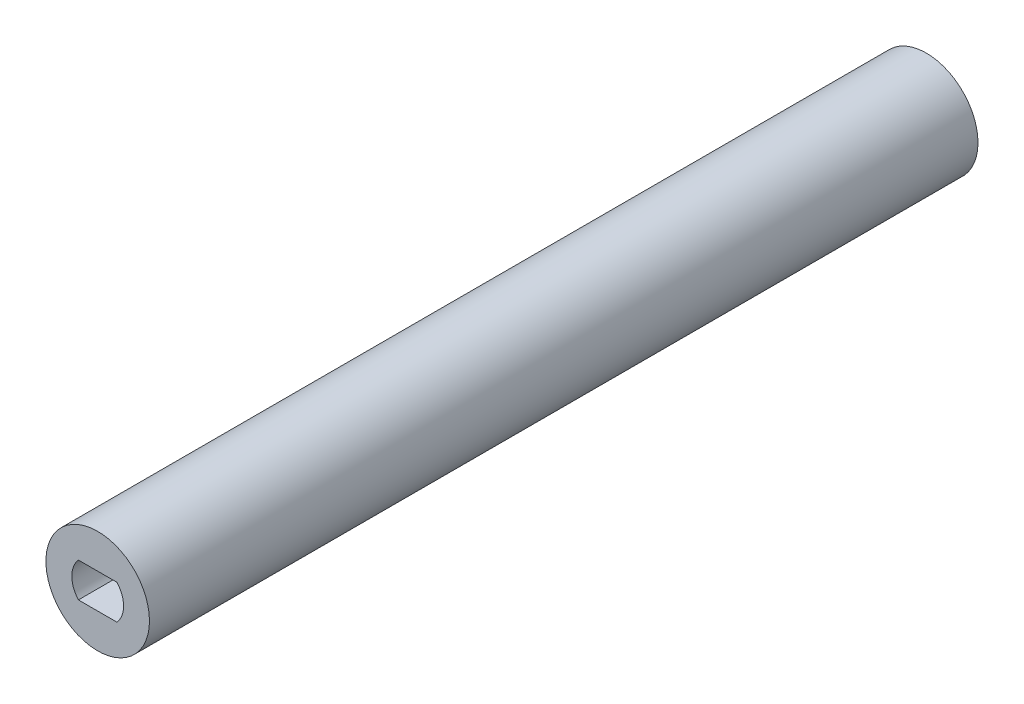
ISO-10303-21;
HEADER;
FILE_DESCRIPTION(('STEP AP214'),'2;1');
FILE_NAME('part.step','',(''),(''),'','','');
FILE_SCHEMA(('AUTOMOTIVE_DESIGN { 1 0 10303 214 1 1 1 1 }'));
ENDSEC;
DATA;
#1=APPLICATION_CONTEXT('core data for automotive mechanical design processes');
#2=APPLICATION_PROTOCOL_DEFINITION('international standard','automotive_design',2000,#1);
#3=PRODUCT_CONTEXT('',#1,'mechanical');
#4=PRODUCT('Part','Part','',(#3));
#5=PRODUCT_RELATED_PRODUCT_CATEGORY('part','',(#4));
#6=PRODUCT_DEFINITION_FORMATION('','',#4);
#7=PRODUCT_DEFINITION_CONTEXT('part definition',#1,'design');
#8=PRODUCT_DEFINITION('design','',#6,#7);
#9=PRODUCT_DEFINITION_SHAPE('','',#8);
#10=(LENGTH_UNIT() NAMED_UNIT(*) SI_UNIT(.MILLI.,.METRE.));
#11=(NAMED_UNIT(*) PLANE_ANGLE_UNIT() SI_UNIT($,.RADIAN.));
#12=(NAMED_UNIT(*) SI_UNIT($,.STERADIAN.) SOLID_ANGLE_UNIT());
#13=UNCERTAINTY_MEASURE_WITH_UNIT(LENGTH_MEASURE(1.E-05),#10,'distance_accuracy_value','');
#14=(GEOMETRIC_REPRESENTATION_CONTEXT(3) GLOBAL_UNCERTAINTY_ASSIGNED_CONTEXT((#13)) GLOBAL_UNIT_ASSIGNED_CONTEXT((#10,
#11,#12)) REPRESENTATION_CONTEXT('',''));
#15=CARTESIAN_POINT('',(0.,0.,0.));
#16=DIRECTION('',(0.,0.,1.));
#17=DIRECTION('',(1.,0.,0.));
#18=AXIS2_PLACEMENT_3D('',#15,#16,#17);
#19=CARTESIAN_POINT('',(0.,0.,48.));
#20=DIRECTION('',(0.,0.,-1.));
#21=DIRECTION('',(-1.,0.,0.));
#22=AXIS2_PLACEMENT_3D('',#19,#20,#21);
#23=CYLINDRICAL_SURFACE('',#22,6.);
#24=CARTESIAN_POINT('',(0.,0.,48.));
#25=DIRECTION('',(0.,0.,1.));
#26=DIRECTION('',(1.,0.,0.));
#27=AXIS2_PLACEMENT_3D('',#24,#25,#26);
#28=CIRCLE('',#27,6.);
#29=CARTESIAN_POINT('',(6.,0.,48.));
#30=VERTEX_POINT('',#29);
#31=EDGE_CURVE('E11',#30,#30,#28,.T.);
#32=ORIENTED_EDGE('',*,*,#31,.F.);
#33=EDGE_LOOP('',(#32));
#34=FACE_BOUND('',#33,.T.);
#35=CARTESIAN_POINT('',(0.,0.,-48.));
#36=DIRECTION('',(0.,0.,1.));
#37=DIRECTION('',(1.,0.,0.));
#38=AXIS2_PLACEMENT_3D('',#35,#36,#37);
#39=CIRCLE('',#38,6.);
#40=CARTESIAN_POINT('',(6.,0.,-48.));
#41=VERTEX_POINT('',#40);
#42=EDGE_CURVE('E36',#41,#41,#39,.T.);
#43=ORIENTED_EDGE('',*,*,#42,.T.);
#44=EDGE_LOOP('',(#43));
#45=FACE_BOUND('',#44,.T.);
#46=ADVANCED_FACE('F33',(#34,#45),#23,.T.);
#47=CARTESIAN_POINT('',(0.,0.,48.));
#48=DIRECTION('',(0.,0.,1.));
#49=DIRECTION('',(1.,0.,0.));
#50=AXIS2_PLACEMENT_3D('',#47,#48,#49);
#51=PLANE('',#50);
#52=DIRECTION('',(-1.,0.,0.));
#53=VECTOR('',#52,1.);
#54=CARTESIAN_POINT('',(0.,2.,48.));
#55=LINE('',#54,#53);
#56=CARTESIAN_POINT('',(2.23606797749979,2.,48.));
#57=VERTEX_POINT('',#56);
#58=CARTESIAN_POINT('',(-2.23606797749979,2.,48.));
#59=VERTEX_POINT('',#58);
#60=EDGE_CURVE('E47',#57,#59,#55,.T.);
#61=ORIENTED_EDGE('',*,*,#60,.F.);
#62=CARTESIAN_POINT('',(0.,0.,48.));
#63=DIRECTION('',(0.,0.,1.));
#64=DIRECTION('',(1.,0.,0.));
#65=AXIS2_PLACEMENT_3D('',#62,#63,#64);
#66=CIRCLE('',#65,3.);
#67=CARTESIAN_POINT('',(2.23606797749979,-2.,48.));
#68=VERTEX_POINT('',#67);
#69=EDGE_CURVE('E98',#68,#57,#66,.T.);
#70=ORIENTED_EDGE('',*,*,#69,.F.);
#71=DIRECTION('',(-1.,0.,0.));
#72=VECTOR('',#71,1.);
#73=CARTESIAN_POINT('',(0.,-2.,48.));
#74=LINE('',#73,#72);
#75=CARTESIAN_POINT('',(-2.23606797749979,-2.,48.));
#76=VERTEX_POINT('',#75);
#77=EDGE_CURVE('E104',#68,#76,#74,.T.);
#78=ORIENTED_EDGE('',*,*,#77,.T.);
#79=EDGE_CURVE('E92',#59,#76,#66,.T.);
#80=ORIENTED_EDGE('',*,*,#79,.F.);
#81=EDGE_LOOP('',(#61,#70,#78,#80));
#82=FACE_BOUND('',#81,.T.);
#83=ORIENTED_EDGE('',*,*,#31,.T.);
#84=EDGE_LOOP('',(#83));
#85=FACE_BOUND('',#84,.T.);
#86=ADVANCED_FACE('F110',(#82,#85),#51,.T.);
#87=CARTESIAN_POINT('',(0.,0.,-48.));
#88=DIRECTION('',(0.,0.,1.));
#89=DIRECTION('',(1.,0.,0.));
#90=AXIS2_PLACEMENT_3D('',#87,#88,#89);
#91=PLANE('',#90);
#92=ORIENTED_EDGE('',*,*,#42,.F.);
#93=EDGE_LOOP('',(#92));
#94=FACE_BOUND('',#93,.T.);
#95=ADVANCED_FACE('F113',(#94),#91,.F.);
#96=CARTESIAN_POINT('',(0.,2.,40.));
#97=DIRECTION('',(0.,1.,0.));
#98=DIRECTION('',(0.,0.,1.));
#99=AXIS2_PLACEMENT_3D('',#96,#97,#98);
#100=PLANE('',#99);
#101=ORIENTED_EDGE('',*,*,#60,.T.);
#102=DIRECTION('',(0.,0.,1.));
#103=VECTOR('',#102,1.);
#104=CARTESIAN_POINT('',(-2.23606797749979,2.,40.));
#105=LINE('',#104,#103);
#106=CARTESIAN_POINT('',(-2.23606797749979,2.,40.));
#107=VERTEX_POINT('',#106);
#108=EDGE_CURVE('E70',#107,#59,#105,.T.);
#109=ORIENTED_EDGE('',*,*,#108,.F.);
#110=DIRECTION('',(-1.,0.,0.));
#111=VECTOR('',#110,1.);
#112=CARTESIAN_POINT('',(0.,2.,40.));
#113=LINE('',#112,#111);
#114=CARTESIAN_POINT('',(2.23606797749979,2.,40.));
#115=VERTEX_POINT('',#114);
#116=EDGE_CURVE('E96',#115,#107,#113,.T.);
#117=ORIENTED_EDGE('',*,*,#116,.F.);
#118=DIRECTION('',(0.,0.,1.));
#119=VECTOR('',#118,1.);
#120=CARTESIAN_POINT('',(2.23606797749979,2.,40.));
#121=LINE('',#120,#119);
#122=EDGE_CURVE('E55',#115,#57,#121,.T.);
#123=ORIENTED_EDGE('',*,*,#122,.T.);
#124=EDGE_LOOP('',(#101,#109,#117,#123));
#125=FACE_BOUND('',#124,.T.);
#126=ADVANCED_FACE('F123',(#125),#100,.F.);
#127=CARTESIAN_POINT('',(0.,0.,40.));
#128=DIRECTION('',(0.,0.,1.));
#129=DIRECTION('',(1.,0.,0.));
#130=AXIS2_PLACEMENT_3D('',#127,#128,#129);
#131=CYLINDRICAL_SURFACE('',#130,3.);
#132=ORIENTED_EDGE('',*,*,#69,.T.);
#133=ORIENTED_EDGE('',*,*,#122,.F.);
#134=CARTESIAN_POINT('',(0.,0.,40.));
#135=DIRECTION('',(0.,0.,1.));
#136=DIRECTION('',(1.,0.,0.));
#137=AXIS2_PLACEMENT_3D('',#134,#135,#136);
#138=CIRCLE('',#137,3.);
#139=CARTESIAN_POINT('',(2.23606797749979,-2.,40.));
#140=VERTEX_POINT('',#139);
#141=EDGE_CURVE('E85',#140,#115,#138,.T.);
#142=ORIENTED_EDGE('',*,*,#141,.F.);
#143=DIRECTION('',(0.,0.,1.));
#144=VECTOR('',#143,1.);
#145=CARTESIAN_POINT('',(2.23606797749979,-2.,40.));
#146=LINE('',#145,#144);
#147=EDGE_CURVE('E81',#140,#68,#146,.T.);
#148=ORIENTED_EDGE('',*,*,#147,.T.);
#149=EDGE_LOOP('',(#132,#133,#142,#148));
#150=FACE_BOUND('',#149,.T.);
#151=ADVANCED_FACE('F108',(#150),#131,.F.);
#152=CARTESIAN_POINT('',(0.,-2.,40.));
#153=DIRECTION('',(0.,1.,0.));
#154=DIRECTION('',(0.,0.,1.));
#155=AXIS2_PLACEMENT_3D('',#152,#153,#154);
#156=PLANE('',#155);
#157=ORIENTED_EDGE('',*,*,#77,.F.);
#158=ORIENTED_EDGE('',*,*,#147,.F.);
#159=DIRECTION('',(-1.,0.,0.));
#160=VECTOR('',#159,1.);
#161=CARTESIAN_POINT('',(0.,-2.,40.));
#162=LINE('',#161,#160);
#163=CARTESIAN_POINT('',(-2.23606797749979,-2.,40.));
#164=VERTEX_POINT('',#163);
#165=EDGE_CURVE('E75',#140,#164,#162,.T.);
#166=ORIENTED_EDGE('',*,*,#165,.T.);
#167=DIRECTION('',(0.,0.,1.));
#168=VECTOR('',#167,1.);
#169=CARTESIAN_POINT('',(-2.23606797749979,-2.,40.));
#170=LINE('',#169,#168);
#171=EDGE_CURVE('E79',#164,#76,#170,.T.);
#172=ORIENTED_EDGE('',*,*,#171,.T.);
#173=EDGE_LOOP('',(#157,#158,#166,#172));
#174=FACE_BOUND('',#173,.T.);
#175=ADVANCED_FACE('F78',(#174),#156,.T.);
#176=ORIENTED_EDGE('',*,*,#79,.T.);
#177=ORIENTED_EDGE('',*,*,#171,.F.);
#178=EDGE_CURVE('E86',#107,#164,#138,.T.);
#179=ORIENTED_EDGE('',*,*,#178,.F.);
#180=ORIENTED_EDGE('',*,*,#108,.T.);
#181=EDGE_LOOP('',(#176,#177,#179,#180));
#182=FACE_BOUND('',#181,.T.);
#183=ADVANCED_FACE('F89',(#182),#131,.F.);
#184=CARTESIAN_POINT('',(0.,0.,40.));
#185=DIRECTION('',(0.,0.,1.));
#186=DIRECTION('',(1.,0.,0.));
#187=AXIS2_PLACEMENT_3D('',#184,#185,#186);
#188=PLANE('',#187);
#189=ORIENTED_EDGE('',*,*,#116,.T.);
#190=ORIENTED_EDGE('',*,*,#178,.T.);
#191=ORIENTED_EDGE('',*,*,#165,.F.);
#192=ORIENTED_EDGE('',*,*,#141,.T.);
#193=EDGE_LOOP('',(#189,#190,#191,#192));
#194=FACE_BOUND('',#193,.T.);
#195=ADVANCED_FACE('F95',(#194),#188,.T.);
#196=CLOSED_SHELL('',(#46,#86,#95,#126,#151,#175,#183,#195));
#197=MANIFOLD_SOLID_BREP('B2',#196);
#198=ADVANCED_BREP_SHAPE_REPRESENTATION('',(#18,#197),#14);
#199=SHAPE_DEFINITION_REPRESENTATION(#9,#198);
ENDSEC;
END-ISO-10303-21;
